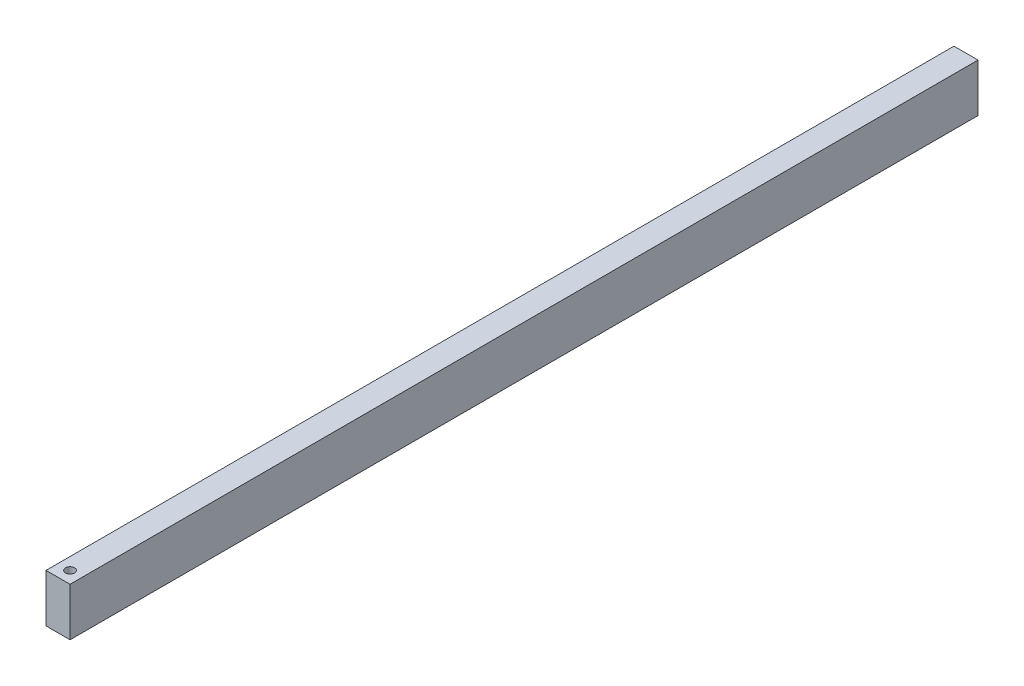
ISO-10303-21;
HEADER;
FILE_DESCRIPTION(('STEP AP214'),'2;1');
FILE_NAME('part.step','',(''),(''),'','','');
FILE_SCHEMA(('AUTOMOTIVE_DESIGN { 1 0 10303 214 1 1 1 1 }'));
ENDSEC;
DATA;
#1=APPLICATION_CONTEXT('core data for automotive mechanical design processes');
#2=APPLICATION_PROTOCOL_DEFINITION('international standard','automotive_design',2000,#1);
#3=PRODUCT_CONTEXT('',#1,'mechanical');
#4=PRODUCT('Part','Part','',(#3));
#5=PRODUCT_RELATED_PRODUCT_CATEGORY('part','',(#4));
#6=PRODUCT_DEFINITION_FORMATION('','',#4);
#7=PRODUCT_DEFINITION_CONTEXT('part definition',#1,'design');
#8=PRODUCT_DEFINITION('design','',#6,#7);
#9=PRODUCT_DEFINITION_SHAPE('','',#8);
#10=(LENGTH_UNIT() NAMED_UNIT(*) SI_UNIT(.MILLI.,.METRE.));
#11=(NAMED_UNIT(*) PLANE_ANGLE_UNIT() SI_UNIT($,.RADIAN.));
#12=(NAMED_UNIT(*) SI_UNIT($,.STERADIAN.) SOLID_ANGLE_UNIT());
#13=UNCERTAINTY_MEASURE_WITH_UNIT(LENGTH_MEASURE(1.E-05),#10,'distance_accuracy_value','');
#14=(GEOMETRIC_REPRESENTATION_CONTEXT(3) GLOBAL_UNCERTAINTY_ASSIGNED_CONTEXT((#13)) GLOBAL_UNIT_ASSIGNED_CONTEXT((#10,
#11,#12)) REPRESENTATION_CONTEXT('',''));
#15=CARTESIAN_POINT('',(0.,0.,0.));
#16=DIRECTION('',(0.,0.,1.));
#17=DIRECTION('',(1.,0.,0.));
#18=AXIS2_PLACEMENT_3D('',#15,#16,#17);
#19=CARTESIAN_POINT('',(0.,0.,1917.7));
#20=DIRECTION('',(1.,0.,0.));
#21=DIRECTION('',(0.,1.,0.));
#22=AXIS2_PLACEMENT_3D('',#19,#20,#21);
#23=PLANE('',#22);
#24=DIRECTION('',(0.,-1.,0.));
#25=VECTOR('',#24,1.);
#26=CARTESIAN_POINT('',(0.,0.,0.));
#27=LINE('',#26,#25);
#28=CARTESIAN_POINT('',(0.,101.6,0.));
#29=VERTEX_POINT('',#28);
#30=CARTESIAN_POINT('',(0.,0.,0.));
#31=VERTEX_POINT('',#30);
#32=EDGE_CURVE('E108',#29,#31,#27,.T.);
#33=ORIENTED_EDGE('',*,*,#32,.T.);
#34=DIRECTION('',(0.,0.,-1.));
#35=VECTOR('',#34,1.);
#36=CARTESIAN_POINT('',(0.,0.,1917.7));
#37=LINE('',#36,#35);
#38=CARTESIAN_POINT('',(0.,0.,1917.7));
#39=VERTEX_POINT('',#38);
#40=EDGE_CURVE('E11',#39,#31,#37,.T.);
#41=ORIENTED_EDGE('',*,*,#40,.F.);
#42=DIRECTION('',(0.,-1.,0.));
#43=VECTOR('',#42,1.);
#44=CARTESIAN_POINT('',(0.,0.,1917.7));
#45=LINE('',#44,#43);
#46=CARTESIAN_POINT('',(0.,101.6,1917.7));
#47=VERTEX_POINT('',#46);
#48=EDGE_CURVE('E96',#47,#39,#45,.T.);
#49=ORIENTED_EDGE('',*,*,#48,.F.);
#50=DIRECTION('',(0.,0.,-1.));
#51=VECTOR('',#50,1.);
#52=CARTESIAN_POINT('',(0.,101.6,1917.7));
#53=LINE('',#52,#51);
#54=EDGE_CURVE('E104',#47,#29,#53,.T.);
#55=ORIENTED_EDGE('',*,*,#54,.T.);
#56=EDGE_LOOP('',(#33,#41,#49,#55));
#57=FACE_BOUND('',#56,.T.);
#58=ADVANCED_FACE('F45',(#57),#23,.F.);
#59=CARTESIAN_POINT('',(0.,0.,1917.7));
#60=DIRECTION('',(0.,1.,0.));
#61=DIRECTION('',(0.,0.,1.));
#62=AXIS2_PLACEMENT_3D('',#59,#60,#61);
#63=PLANE('',#62);
#64=DIRECTION('',(1.,0.,0.));
#65=VECTOR('',#64,1.);
#66=CARTESIAN_POINT('',(0.,0.,0.));
#67=LINE('',#66,#65);
#68=CARTESIAN_POINT('',(50.8,0.,0.));
#69=VERTEX_POINT('',#68);
#70=EDGE_CURVE('E100',#31,#69,#67,.T.);
#71=ORIENTED_EDGE('',*,*,#70,.T.);
#72=DIRECTION('',(0.,0.,-1.));
#73=VECTOR('',#72,1.);
#74=CARTESIAN_POINT('',(50.8,0.,1917.7));
#75=LINE('',#74,#73);
#76=CARTESIAN_POINT('',(50.8,0.,1917.7));
#77=VERTEX_POINT('',#76);
#78=EDGE_CURVE('E53',#77,#69,#75,.T.);
#79=ORIENTED_EDGE('',*,*,#78,.F.);
#80=DIRECTION('',(1.,0.,0.));
#81=VECTOR('',#80,1.);
#82=CARTESIAN_POINT('',(0.,0.,1917.7));
#83=LINE('',#82,#81);
#84=EDGE_CURVE('E91',#39,#77,#83,.T.);
#85=ORIENTED_EDGE('',*,*,#84,.F.);
#86=ORIENTED_EDGE('',*,*,#40,.T.);
#87=EDGE_LOOP('',(#71,#79,#85,#86));
#88=FACE_BOUND('',#87,.T.);
#89=ADVANCED_FACE('F99',(#88),#63,.F.);
#90=CARTESIAN_POINT('',(50.8,0.,1917.7));
#91=DIRECTION('',(-1.,0.,0.));
#92=DIRECTION('',(0.,-1.,0.));
#93=AXIS2_PLACEMENT_3D('',#90,#91,#92);
#94=PLANE('',#93);
#95=DIRECTION('',(0.,1.,0.));
#96=VECTOR('',#95,1.);
#97=CARTESIAN_POINT('',(50.8,0.,0.));
#98=LINE('',#97,#96);
#99=CARTESIAN_POINT('',(50.8,101.6,0.));
#100=VERTEX_POINT('',#99);
#101=EDGE_CURVE('E78',#69,#100,#98,.T.);
#102=ORIENTED_EDGE('',*,*,#101,.T.);
#103=DIRECTION('',(0.,0.,-1.));
#104=VECTOR('',#103,1.);
#105=CARTESIAN_POINT('',(50.8,101.6,1917.7));
#106=LINE('',#105,#104);
#107=CARTESIAN_POINT('',(50.8,101.6,1917.7));
#108=VERTEX_POINT('',#107);
#109=EDGE_CURVE('E101',#108,#100,#106,.T.);
#110=ORIENTED_EDGE('',*,*,#109,.F.);
#111=DIRECTION('',(0.,1.,0.));
#112=VECTOR('',#111,1.);
#113=CARTESIAN_POINT('',(50.8,0.,1917.7));
#114=LINE('',#113,#112);
#115=EDGE_CURVE('E94',#77,#108,#114,.T.);
#116=ORIENTED_EDGE('',*,*,#115,.F.);
#117=ORIENTED_EDGE('',*,*,#78,.T.);
#118=EDGE_LOOP('',(#102,#110,#116,#117));
#119=FACE_BOUND('',#118,.T.);
#120=ADVANCED_FACE('F102',(#119),#94,.F.);
#121=CARTESIAN_POINT('',(0.,101.6,1917.7));
#122=DIRECTION('',(0.,-1.,0.));
#123=DIRECTION('',(0.,0.,-1.));
#124=AXIS2_PLACEMENT_3D('',#121,#122,#123);
#125=PLANE('',#124);
#126=CARTESIAN_POINT('',(25.4,101.6,1892.3));
#127=DIRECTION('',(0.,1.,0.));
#128=DIRECTION('',(0.,0.,1.));
#129=AXIS2_PLACEMENT_3D('',#126,#127,#128);
#130=CIRCLE('',#129,9.52500000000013);
#131=CARTESIAN_POINT('',(25.4,101.6,1901.825));
#132=VERTEX_POINT('',#131);
#133=EDGE_CURVE('E122',#132,#132,#130,.T.);
#134=ORIENTED_EDGE('',*,*,#133,.F.);
#135=EDGE_LOOP('',(#134));
#136=FACE_BOUND('',#135,.T.);
#137=DIRECTION('',(-1.,0.,0.));
#138=VECTOR('',#137,1.);
#139=CARTESIAN_POINT('',(0.,101.6,0.));
#140=LINE('',#139,#138);
#141=EDGE_CURVE('E84',#100,#29,#140,.T.);
#142=ORIENTED_EDGE('',*,*,#141,.T.);
#143=ORIENTED_EDGE('',*,*,#54,.F.);
#144=DIRECTION('',(-1.,0.,0.));
#145=VECTOR('',#144,1.);
#146=CARTESIAN_POINT('',(0.,101.6,1917.7));
#147=LINE('',#146,#145);
#148=EDGE_CURVE('E61',#108,#47,#147,.T.);
#149=ORIENTED_EDGE('',*,*,#148,.F.);
#150=ORIENTED_EDGE('',*,*,#109,.T.);
#151=EDGE_LOOP('',(#142,#143,#149,#150));
#152=FACE_BOUND('',#151,.T.);
#153=ADVANCED_FACE('F116',(#136,#152),#125,.F.);
#154=CARTESIAN_POINT('',(0.,0.,1917.7));
#155=DIRECTION('',(0.,0.,-1.));
#156=DIRECTION('',(-1.,0.,0.));
#157=AXIS2_PLACEMENT_3D('',#154,#155,#156);
#158=PLANE('',#157);
#159=ORIENTED_EDGE('',*,*,#48,.T.);
#160=ORIENTED_EDGE('',*,*,#84,.T.);
#161=ORIENTED_EDGE('',*,*,#115,.T.);
#162=ORIENTED_EDGE('',*,*,#148,.T.);
#163=EDGE_LOOP('',(#159,#160,#161,#162));
#164=FACE_BOUND('',#163,.T.);
#165=ADVANCED_FACE('F92',(#164),#158,.F.);
#166=CARTESIAN_POINT('',(0.,0.,0.));
#167=DIRECTION('',(0.,0.,-1.));
#168=DIRECTION('',(-1.,0.,0.));
#169=AXIS2_PLACEMENT_3D('',#166,#167,#168);
#170=PLANE('',#169);
#171=ORIENTED_EDGE('',*,*,#32,.F.);
#172=ORIENTED_EDGE('',*,*,#141,.F.);
#173=ORIENTED_EDGE('',*,*,#101,.F.);
#174=ORIENTED_EDGE('',*,*,#70,.F.);
#175=EDGE_LOOP('',(#171,#172,#173,#174));
#176=FACE_BOUND('',#175,.T.);
#177=ADVANCED_FACE('F119',(#176),#170,.T.);
#178=CARTESIAN_POINT('',(25.4,25.4,1892.3));
#179=DIRECTION('',(0.,1.,0.));
#180=DIRECTION('',(0.,0.,1.));
#181=AXIS2_PLACEMENT_3D('',#178,#179,#180);
#182=CYLINDRICAL_SURFACE('',#181,9.52500000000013);
#183=CARTESIAN_POINT('',(25.4,25.4,1892.3));
#184=DIRECTION('',(0.,1.,0.));
#185=DIRECTION('',(0.,0.,1.));
#186=AXIS2_PLACEMENT_3D('',#183,#184,#185);
#187=CIRCLE('',#186,9.52500000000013);
#188=CARTESIAN_POINT('',(25.4,25.4,1901.825));
#189=VERTEX_POINT('',#188);
#190=EDGE_CURVE('E111',#189,#189,#187,.T.);
#191=CARTESIAN_POINT('',(25.4,25.4,1901.825));
#192=CARTESIAN_POINT('',(25.4,26.19375,1901.825));
#193=CARTESIAN_POINT('',(25.4,26.9875,1901.825));
#194=CARTESIAN_POINT('',(25.4,28.575,1901.825));
#195=CARTESIAN_POINT('',(25.4,29.36875,1901.825));
#196=CARTESIAN_POINT('',(25.4,30.95625,1901.825));
#197=CARTESIAN_POINT('',(25.4,31.75,1901.825));
#198=CARTESIAN_POINT('',(25.4,33.3375,1901.825));
#199=CARTESIAN_POINT('',(25.4,34.13125,1901.825));
#200=CARTESIAN_POINT('',(25.4,35.71875,1901.825));
#201=CARTESIAN_POINT('',(25.4,36.5125,1901.825));
#202=CARTESIAN_POINT('',(25.4,38.1,1901.825));
#203=CARTESIAN_POINT('',(25.4,38.89375,1901.825));
#204=CARTESIAN_POINT('',(25.4,40.48125,1901.825));
#205=CARTESIAN_POINT('',(25.4,41.275,1901.825));
#206=CARTESIAN_POINT('',(25.4,42.8625,1901.825));
#207=CARTESIAN_POINT('',(25.4,43.65625,1901.825));
#208=CARTESIAN_POINT('',(25.4,45.24375,1901.825));
#209=CARTESIAN_POINT('',(25.4,46.0375,1901.825));
#210=CARTESIAN_POINT('',(25.4,47.625,1901.825));
#211=CARTESIAN_POINT('',(25.4,48.41875,1901.825));
#212=CARTESIAN_POINT('',(25.4,50.00625,1901.825));
#213=CARTESIAN_POINT('',(25.4,50.8,1901.825));
#214=CARTESIAN_POINT('',(25.4,52.3875,1901.825));
#215=CARTESIAN_POINT('',(25.4,53.18125,1901.825));
#216=CARTESIAN_POINT('',(25.4,54.76875,1901.825));
#217=CARTESIAN_POINT('',(25.4,55.5625,1901.825));
#218=CARTESIAN_POINT('',(25.4,57.15,1901.825));
#219=CARTESIAN_POINT('',(25.4,57.94375,1901.825));
#220=CARTESIAN_POINT('',(25.4,59.53125,1901.825));
#221=CARTESIAN_POINT('',(25.4,60.325,1901.825));
#222=CARTESIAN_POINT('',(25.4,61.9125,1901.825));
#223=CARTESIAN_POINT('',(25.4,62.70625,1901.825));
#224=CARTESIAN_POINT('',(25.4,64.29375,1901.825));
#225=CARTESIAN_POINT('',(25.4,65.0875,1901.825));
#226=CARTESIAN_POINT('',(25.4,66.675,1901.825));
#227=CARTESIAN_POINT('',(25.4,67.46875,1901.825));
#228=CARTESIAN_POINT('',(25.4,69.05625,1901.825));
#229=CARTESIAN_POINT('',(25.4,69.85,1901.825));
#230=CARTESIAN_POINT('',(25.4,71.4375,1901.825));
#231=CARTESIAN_POINT('',(25.4,72.23125,1901.825));
#232=CARTESIAN_POINT('',(25.4,73.81875,1901.825));
#233=CARTESIAN_POINT('',(25.4,74.6125,1901.825));
#234=CARTESIAN_POINT('',(25.4,76.2,1901.825));
#235=CARTESIAN_POINT('',(25.4,76.99375,1901.825));
#236=CARTESIAN_POINT('',(25.4,78.58125,1901.825));
#237=CARTESIAN_POINT('',(25.4,79.375,1901.825));
#238=CARTESIAN_POINT('',(25.4,80.9625,1901.825));
#239=CARTESIAN_POINT('',(25.4,81.75625,1901.825));
#240=CARTESIAN_POINT('',(25.4,83.34375,1901.825));
#241=CARTESIAN_POINT('',(25.4,84.1375,1901.825));
#242=CARTESIAN_POINT('',(25.4,85.725,1901.825));
#243=CARTESIAN_POINT('',(25.4,86.51875,1901.825));
#244=CARTESIAN_POINT('',(25.4,88.10625,1901.825));
#245=CARTESIAN_POINT('',(25.4,88.9,1901.825));
#246=CARTESIAN_POINT('',(25.4,90.4875,1901.825));
#247=CARTESIAN_POINT('',(25.4,91.28125,1901.825));
#248=CARTESIAN_POINT('',(25.4,92.86875,1901.825));
#249=CARTESIAN_POINT('',(25.4,93.6625,1901.825));
#250=CARTESIAN_POINT('',(25.4,95.25,1901.825));
#251=CARTESIAN_POINT('',(25.4,96.04375,1901.825));
#252=CARTESIAN_POINT('',(25.4,97.63125,1901.825));
#253=CARTESIAN_POINT('',(25.4,98.425,1901.825));
#254=CARTESIAN_POINT('',(25.4,100.0125,1901.825));
#255=CARTESIAN_POINT('',(25.4,100.80625,1901.825));
#256=CARTESIAN_POINT('',(25.4,101.6,1901.825));
#257=B_SPLINE_CURVE_WITH_KNOTS('',3,(#191,#192,#193,#194,#195,#196,#197,#198,#199,#200,#201,
#202,#203,#204,#205,#206,#207,#208,#209,#210,#211,#212,#213,#214,#215,#216,#217,#218,#219,#220,
#221,#222,#223,#224,#225,#226,#227,#228,#229,#230,#231,#232,#233,#234,#235,#236,#237,#238,#239,
#240,#241,#242,#243,#244,#245,#246,#247,#248,#249,#250,#251,#252,#253,#254,#255,#256),
.UNSPECIFIED.,.F.,.F.,(4,2,2,2,2,2,2,2,2,2,2,2,2,2,2,2,2,2,2,2,2,2,2,2,2,2,2,2,2,2,2,2,4),(0.,
2.38125,4.7625,7.14375,9.525,11.90625,14.2875,16.66875,19.05,21.43125,23.8125,26.19375,28.575,
30.95625,33.3375,35.71875,38.1,40.48125,42.8625,45.24375,47.625,50.00625,52.3875,54.76875,57.15,
59.53125,61.9125,64.29375,66.675,69.05625,71.4375,73.81875,76.2),.UNSPECIFIED.);
#258=EDGE_CURVE('BSEAM130',#189,#132,#257,.T.);
#259=ORIENTED_EDGE('',*,*,#190,.F.);
#260=ORIENTED_EDGE('',*,*,#133,.T.);
#261=ORIENTED_EDGE('',*,*,#258,.T.);
#262=ORIENTED_EDGE('',*,*,#258,.F.);
#263=EDGE_LOOP('',(#259,#261,#260,#262));
#264=FACE_BOUND('',#263,.T.);
#265=ADVANCED_FACE('F130',(#264),#182,.F.);
#266=CARTESIAN_POINT('',(25.4,25.4,1892.3));
#267=DIRECTION('',(0.,1.,0.));
#268=DIRECTION('',(0.,0.,1.));
#269=AXIS2_PLACEMENT_3D('',#266,#267,#268);
#270=PLANE('',#269);
#271=ORIENTED_EDGE('',*,*,#190,.T.);
#272=EDGE_LOOP('',(#271));
#273=FACE_BOUND('',#272,.T.);
#274=ADVANCED_FACE('F128',(#273),#270,.T.);
#275=CLOSED_SHELL('',(#58,#89,#120,#153,#165,#177,#265,#274));
#276=MANIFOLD_SOLID_BREP('B2',#275);
#277=ADVANCED_BREP_SHAPE_REPRESENTATION('',(#18,#276),#14);
#278=SHAPE_DEFINITION_REPRESENTATION(#9,#277);
ENDSEC;
END-ISO-10303-21;
